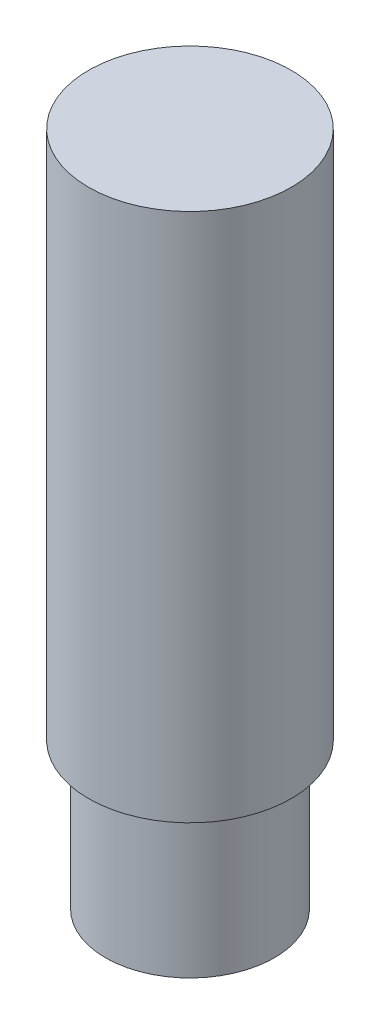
ISO-10303-21;
HEADER;
FILE_DESCRIPTION(('STEP AP214'),'2;1');
FILE_NAME('part.step','',(''),(''),'','','');
FILE_SCHEMA(('AUTOMOTIVE_DESIGN { 1 0 10303 214 1 1 1 1 }'));
ENDSEC;
DATA;
#1=APPLICATION_CONTEXT('core data for automotive mechanical design processes');
#2=APPLICATION_PROTOCOL_DEFINITION('international standard','automotive_design',2000,#1);
#3=PRODUCT_CONTEXT('',#1,'mechanical');
#4=PRODUCT('Part','Part','',(#3));
#5=PRODUCT_RELATED_PRODUCT_CATEGORY('part','',(#4));
#6=PRODUCT_DEFINITION_FORMATION('','',#4);
#7=PRODUCT_DEFINITION_CONTEXT('part definition',#1,'design');
#8=PRODUCT_DEFINITION('design','',#6,#7);
#9=PRODUCT_DEFINITION_SHAPE('','',#8);
#10=(LENGTH_UNIT() NAMED_UNIT(*) SI_UNIT(.MILLI.,.METRE.));
#11=(NAMED_UNIT(*) PLANE_ANGLE_UNIT() SI_UNIT($,.RADIAN.));
#12=(NAMED_UNIT(*) SI_UNIT($,.STERADIAN.) SOLID_ANGLE_UNIT());
#13=UNCERTAINTY_MEASURE_WITH_UNIT(LENGTH_MEASURE(1.E-05),#10,'distance_accuracy_value','');
#14=(GEOMETRIC_REPRESENTATION_CONTEXT(3) GLOBAL_UNCERTAINTY_ASSIGNED_CONTEXT((#13)) GLOBAL_UNIT_ASSIGNED_CONTEXT((#10,
#11,#12)) REPRESENTATION_CONTEXT('',''));
#15=CARTESIAN_POINT('',(0.,0.,0.));
#16=DIRECTION('',(0.,0.,1.));
#17=DIRECTION('',(1.,0.,0.));
#18=AXIS2_PLACEMENT_3D('',#15,#16,#17);
#19=CARTESIAN_POINT('',(0.,7.62,0.));
#20=DIRECTION('',(0.,-1.,0.));
#21=DIRECTION('',(0.,0.,-1.));
#22=AXIS2_PLACEMENT_3D('',#19,#20,#21);
#23=CYLINDRICAL_SURFACE('',#22,1.905);
#24=CARTESIAN_POINT('',(0.,-7.62,0.));
#25=DIRECTION('',(0.,1.,0.));
#26=DIRECTION('',(0.,0.,1.));
#27=AXIS2_PLACEMENT_3D('',#24,#25,#26);
#28=CIRCLE('',#27,1.905);
#29=CARTESIAN_POINT('',(0.,-7.62,-1.905));
#30=VERTEX_POINT('',#29);
#31=EDGE_CURVE('E39',#30,#30,#28,.T.);
#32=CARTESIAN_POINT('',(0.,-4.32,0.));
#33=DIRECTION('',(0.,1.,0.));
#34=DIRECTION('',(0.,0.,1.));
#35=AXIS2_PLACEMENT_3D('',#32,#33,#34);
#36=CIRCLE('',#35,1.905);
#37=CARTESIAN_POINT('',(0.,-4.32,-1.905));
#38=VERTEX_POINT('',#37);
#39=EDGE_CURVE('E11',#38,#38,#36,.T.);
#40=CARTESIAN_POINT('',(0.,-7.62,-1.905));
#41=CARTESIAN_POINT('',(0.,-7.585625,-1.905));
#42=CARTESIAN_POINT('',(0.,-7.55125,-1.905));
#43=CARTESIAN_POINT('',(0.,-7.4825,-1.905));
#44=CARTESIAN_POINT('',(0.,-7.448125,-1.905));
#45=CARTESIAN_POINT('',(0.,-7.379375,-1.905));
#46=CARTESIAN_POINT('',(0.,-7.345,-1.905));
#47=CARTESIAN_POINT('',(0.,-7.27625,-1.905));
#48=CARTESIAN_POINT('',(0.,-7.241875,-1.905));
#49=CARTESIAN_POINT('',(0.,-7.173125,-1.905));
#50=CARTESIAN_POINT('',(0.,-7.13875,-1.905));
#51=CARTESIAN_POINT('',(0.,-7.07,-1.905));
#52=CARTESIAN_POINT('',(0.,-7.035625,-1.905));
#53=CARTESIAN_POINT('',(0.,-6.966875,-1.905));
#54=CARTESIAN_POINT('',(0.,-6.9325,-1.905));
#55=CARTESIAN_POINT('',(0.,-6.86375,-1.905));
#56=CARTESIAN_POINT('',(0.,-6.829375,-1.905));
#57=CARTESIAN_POINT('',(0.,-6.760625,-1.905));
#58=CARTESIAN_POINT('',(0.,-6.72625,-1.905));
#59=CARTESIAN_POINT('',(0.,-6.6575,-1.905));
#60=CARTESIAN_POINT('',(0.,-6.623125,-1.905));
#61=CARTESIAN_POINT('',(0.,-6.554375,-1.905));
#62=CARTESIAN_POINT('',(0.,-6.52,-1.905));
#63=CARTESIAN_POINT('',(0.,-6.45125,-1.905));
#64=CARTESIAN_POINT('',(0.,-6.416875,-1.905));
#65=CARTESIAN_POINT('',(0.,-6.348125,-1.905));
#66=CARTESIAN_POINT('',(0.,-6.31375,-1.905));
#67=CARTESIAN_POINT('',(0.,-6.245,-1.905));
#68=CARTESIAN_POINT('',(0.,-6.210625,-1.905));
#69=CARTESIAN_POINT('',(0.,-6.141875,-1.905));
#70=CARTESIAN_POINT('',(0.,-6.1075,-1.905));
#71=CARTESIAN_POINT('',(0.,-6.03875,-1.905));
#72=CARTESIAN_POINT('',(0.,-6.004375,-1.905));
#73=CARTESIAN_POINT('',(0.,-5.935625,-1.905));
#74=CARTESIAN_POINT('',(0.,-5.90125,-1.905));
#75=CARTESIAN_POINT('',(0.,-5.8325,-1.905));
#76=CARTESIAN_POINT('',(0.,-5.798125,-1.905));
#77=CARTESIAN_POINT('',(0.,-5.729375,-1.905));
#78=CARTESIAN_POINT('',(0.,-5.695,-1.905));
#79=CARTESIAN_POINT('',(0.,-5.62625,-1.905));
#80=CARTESIAN_POINT('',(0.,-5.591875,-1.905));
#81=CARTESIAN_POINT('',(0.,-5.523125,-1.905));
#82=CARTESIAN_POINT('',(0.,-5.48875,-1.905));
#83=CARTESIAN_POINT('',(0.,-5.42,-1.905));
#84=CARTESIAN_POINT('',(0.,-5.385625,-1.905));
#85=CARTESIAN_POINT('',(0.,-5.316875,-1.905));
#86=CARTESIAN_POINT('',(0.,-5.2825,-1.905));
#87=CARTESIAN_POINT('',(0.,-5.21375,-1.905));
#88=CARTESIAN_POINT('',(0.,-5.179375,-1.905));
#89=CARTESIAN_POINT('',(0.,-5.110625,-1.905));
#90=CARTESIAN_POINT('',(0.,-5.07625,-1.905));
#91=CARTESIAN_POINT('',(0.,-5.0075,-1.905));
#92=CARTESIAN_POINT('',(0.,-4.973125,-1.905));
#93=CARTESIAN_POINT('',(0.,-4.904375,-1.905));
#94=CARTESIAN_POINT('',(0.,-4.87,-1.905));
#95=CARTESIAN_POINT('',(0.,-4.80125,-1.905));
#96=CARTESIAN_POINT('',(0.,-4.766875,-1.905));
#97=CARTESIAN_POINT('',(0.,-4.698125,-1.905));
#98=CARTESIAN_POINT('',(0.,-4.66375,-1.905));
#99=CARTESIAN_POINT('',(0.,-4.595,-1.905));
#100=CARTESIAN_POINT('',(0.,-4.560625,-1.905));
#101=CARTESIAN_POINT('',(0.,-4.491875,-1.905));
#102=CARTESIAN_POINT('',(0.,-4.4575,-1.905));
#103=CARTESIAN_POINT('',(0.,-4.38875,-1.905));
#104=CARTESIAN_POINT('',(0.,-4.354375,-1.905));
#105=CARTESIAN_POINT('',(0.,-4.32,-1.905));
#106=B_SPLINE_CURVE_WITH_KNOTS('',3,(#40,#41,#42,#43,#44,#45,#46,#47,#48,#49,#50,#51,#52,#53,
#54,#55,#56,#57,#58,#59,#60,#61,#62,#63,#64,#65,#66,#67,#68,#69,#70,#71,#72,#73,#74,#75,#76,#77,
#78,#79,#80,#81,#82,#83,#84,#85,#86,#87,#88,#89,#90,#91,#92,#93,#94,#95,#96,#97,#98,#99,#100,
#101,#102,#103,#104,#105),.UNSPECIFIED.,.F.,.F.,(4,2,2,2,2,2,2,2,2,2,2,2,2,2,2,2,2,2,2,2,2,2,2,
2,2,2,2,2,2,2,2,2,4),(0.,0.103124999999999,0.20625,0.309375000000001,0.4125,0.515624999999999,
0.618749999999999,0.721875,0.824999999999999,0.928124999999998,1.03125,1.134375,1.2375,1.340625,
1.44375,1.546875,1.65,1.753125,1.85625,1.959375,2.0625,2.165625,2.26875,2.371875,2.475,2.578125,
2.68125,2.784375,2.8875,2.990625,3.09375,3.196875,3.3),.UNSPECIFIED.);
#107=EDGE_CURVE('BSEAM33',#30,#38,#106,.T.);
#108=ORIENTED_EDGE('',*,*,#31,.T.);
#109=ORIENTED_EDGE('',*,*,#39,.F.);
#110=ORIENTED_EDGE('',*,*,#107,.T.);
#111=ORIENTED_EDGE('',*,*,#107,.F.);
#112=EDGE_LOOP('',(#108,#110,#109,#111));
#113=FACE_BOUND('',#112,.T.);
#114=ADVANCED_FACE('F33',(#113),#23,.T.);
#115=CARTESIAN_POINT('',(0.,-7.62,0.));
#116=DIRECTION('',(0.,1.,0.));
#117=DIRECTION('',(0.,0.,1.));
#118=AXIS2_PLACEMENT_3D('',#115,#116,#117);
#119=PLANE('',#118);
#120=ORIENTED_EDGE('',*,*,#31,.F.);
#121=EDGE_LOOP('',(#120));
#122=FACE_BOUND('',#121,.T.);
#123=ADVANCED_FACE('F64',(#122),#119,.F.);
#124=CARTESIAN_POINT('',(0.,-4.32,0.));
#125=DIRECTION('',(0.,1.,0.));
#126=DIRECTION('',(0.,0.,1.));
#127=AXIS2_PLACEMENT_3D('',#124,#125,#126);
#128=PLANE('',#127);
#129=CARTESIAN_POINT('',(0.,-4.32,0.));
#130=DIRECTION('',(0.,1.,0.));
#131=DIRECTION('',(0.,0.,1.));
#132=AXIS2_PLACEMENT_3D('',#129,#130,#131);
#133=CIRCLE('',#132,2.286);
#134=CARTESIAN_POINT('',(0.,-4.32,2.286));
#135=VERTEX_POINT('',#134);
#136=EDGE_CURVE('E43',#135,#135,#133,.F.);
#137=ORIENTED_EDGE('',*,*,#136,.T.);
#138=EDGE_LOOP('',(#137));
#139=FACE_BOUND('',#138,.T.);
#140=ORIENTED_EDGE('',*,*,#39,.T.);
#141=EDGE_LOOP('',(#140));
#142=FACE_BOUND('',#141,.T.);
#143=ADVANCED_FACE('F57',(#139,#142),#128,.F.);
#144=CARTESIAN_POINT('',(0.,-14.0857844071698,0.));
#145=DIRECTION('',(0.,1.,0.));
#146=DIRECTION('',(0.,0.,1.));
#147=AXIS2_PLACEMENT_3D('',#144,#145,#146);
#148=CYLINDRICAL_SURFACE('',#147,2.286);
#149=CARTESIAN_POINT('',(0.,7.62,0.));
#150=DIRECTION('',(0.,1.,0.));
#151=DIRECTION('',(0.,0.,1.));
#152=AXIS2_PLACEMENT_3D('',#149,#150,#151);
#153=CIRCLE('',#152,2.286);
#154=CARTESIAN_POINT('',(0.,7.62,2.286));
#155=VERTEX_POINT('',#154);
#156=EDGE_CURVE('E47',#155,#155,#153,.T.);
#157=CARTESIAN_POINT('',(0.,-4.32,2.286));
#158=CARTESIAN_POINT('',(0.,-4.195625,2.286));
#159=CARTESIAN_POINT('',(0.,-4.07125,2.286));
#160=CARTESIAN_POINT('',(0.,-3.8225,2.286));
#161=CARTESIAN_POINT('',(0.,-3.698125,2.286));
#162=CARTESIAN_POINT('',(0.,-3.449375,2.286));
#163=CARTESIAN_POINT('',(0.,-3.325,2.286));
#164=CARTESIAN_POINT('',(0.,-3.07625,2.286));
#165=CARTESIAN_POINT('',(0.,-2.951875,2.286));
#166=CARTESIAN_POINT('',(0.,-2.703125,2.286));
#167=CARTESIAN_POINT('',(0.,-2.57875,2.286));
#168=CARTESIAN_POINT('',(0.,-2.33,2.286));
#169=CARTESIAN_POINT('',(0.,-2.205625,2.286));
#170=CARTESIAN_POINT('',(0.,-1.956875,2.286));
#171=CARTESIAN_POINT('',(0.,-1.8325,2.286));
#172=CARTESIAN_POINT('',(0.,-1.58375,2.286));
#173=CARTESIAN_POINT('',(0.,-1.459375,2.286));
#174=CARTESIAN_POINT('',(0.,-1.210625,2.286));
#175=CARTESIAN_POINT('',(0.,-1.08625,2.286));
#176=CARTESIAN_POINT('',(0.,-0.837499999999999,2.286));
#177=CARTESIAN_POINT('',(0.,-0.713124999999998,2.286));
#178=CARTESIAN_POINT('',(0.,-0.464374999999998,2.286));
#179=CARTESIAN_POINT('',(0.,-0.339999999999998,2.286));
#180=CARTESIAN_POINT('',(0.,-0.0912499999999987,2.286));
#181=CARTESIAN_POINT('',(0.,0.0331250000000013,2.286));
#182=CARTESIAN_POINT('',(0.,0.281875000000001,2.286));
#183=CARTESIAN_POINT('',(0.,0.406250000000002,2.286));
#184=CARTESIAN_POINT('',(0.,0.655000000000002,2.286));
#185=CARTESIAN_POINT('',(0.,0.779375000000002,2.286));
#186=CARTESIAN_POINT('',(0.,1.028125,2.286));
#187=CARTESIAN_POINT('',(0.,1.1525,2.286));
#188=CARTESIAN_POINT('',(0.,1.40125,2.286));
#189=CARTESIAN_POINT('',(0.,1.525625,2.286));
#190=CARTESIAN_POINT('',(0.,1.774375,2.286));
#191=CARTESIAN_POINT('',(0.,1.89875,2.286));
#192=CARTESIAN_POINT('',(0.,2.1475,2.286));
#193=CARTESIAN_POINT('',(0.,2.271875,2.286));
#194=CARTESIAN_POINT('',(0.,2.520625,2.286));
#195=CARTESIAN_POINT('',(0.,2.645,2.286));
#196=CARTESIAN_POINT('',(0.,2.89375,2.286));
#197=CARTESIAN_POINT('',(0.,3.018125,2.286));
#198=CARTESIAN_POINT('',(0.,3.266875,2.286));
#199=CARTESIAN_POINT('',(0.,3.39125,2.286));
#200=CARTESIAN_POINT('',(0.,3.64,2.286));
#201=CARTESIAN_POINT('',(0.,3.764375,2.286));
#202=CARTESIAN_POINT('',(0.,4.013125,2.286));
#203=CARTESIAN_POINT('',(0.,4.1375,2.286));
#204=CARTESIAN_POINT('',(0.,4.38625,2.286));
#205=CARTESIAN_POINT('',(0.,4.510625,2.286));
#206=CARTESIAN_POINT('',(0.,4.759375,2.286));
#207=CARTESIAN_POINT('',(0.,4.88375,2.286));
#208=CARTESIAN_POINT('',(0.,5.1325,2.286));
#209=CARTESIAN_POINT('',(0.,5.256875,2.286));
#210=CARTESIAN_POINT('',(0.,5.505625,2.286));
#211=CARTESIAN_POINT('',(0.,5.63,2.286));
#212=CARTESIAN_POINT('',(0.,5.87875,2.286));
#213=CARTESIAN_POINT('',(0.,6.003125,2.286));
#214=CARTESIAN_POINT('',(0.,6.251875,2.286));
#215=CARTESIAN_POINT('',(0.,6.37625,2.286));
#216=CARTESIAN_POINT('',(0.,6.625,2.286));
#217=CARTESIAN_POINT('',(0.,6.749375,2.286));
#218=CARTESIAN_POINT('',(0.,6.998125,2.286));
#219=CARTESIAN_POINT('',(0.,7.1225,2.286));
#220=CARTESIAN_POINT('',(0.,7.37125,2.286));
#221=CARTESIAN_POINT('',(0.,7.495625,2.286));
#222=CARTESIAN_POINT('',(0.,7.62,2.286));
#223=B_SPLINE_CURVE_WITH_KNOTS('',3,(#157,#158,#159,#160,#161,#162,#163,#164,#165,#166,#167,
#168,#169,#170,#171,#172,#173,#174,#175,#176,#177,#178,#179,#180,#181,#182,#183,#184,#185,#186,
#187,#188,#189,#190,#191,#192,#193,#194,#195,#196,#197,#198,#199,#200,#201,#202,#203,#204,#205,
#206,#207,#208,#209,#210,#211,#212,#213,#214,#215,#216,#217,#218,#219,#220,#221,#222),
.UNSPECIFIED.,.F.,.F.,(4,2,2,2,2,2,2,2,2,2,2,2,2,2,2,2,2,2,2,2,2,2,2,2,2,2,2,2,2,2,2,2,4),(0.,
0.373125,0.74625,1.119375,1.4925,1.865625,2.23875,2.611875,2.985,3.358125,3.73125,4.104375,
4.4775,4.850625,5.22375,5.596875,5.97,6.343125,6.71625,7.089375,7.4625,7.835625,8.20875,
8.581875,8.955,9.328125,9.70125,10.074375,10.4475,10.820625,11.19375,11.566875,11.94),.UNSPECIFIED.);
#224=EDGE_CURVE('BSEAM55',#135,#155,#223,.T.);
#225=ORIENTED_EDGE('',*,*,#136,.F.);
#226=ORIENTED_EDGE('',*,*,#156,.F.);
#227=ORIENTED_EDGE('',*,*,#224,.T.);
#228=ORIENTED_EDGE('',*,*,#224,.F.);
#229=EDGE_LOOP('',(#225,#227,#226,#228));
#230=FACE_BOUND('',#229,.T.);
#231=ADVANCED_FACE('F55',(#230),#148,.T.);
#232=CARTESIAN_POINT('',(0.,7.62,0.));
#233=DIRECTION('',(0.,1.,0.));
#234=DIRECTION('',(0.,0.,1.));
#235=AXIS2_PLACEMENT_3D('',#232,#233,#234);
#236=PLANE('',#235);
#237=ORIENTED_EDGE('',*,*,#156,.T.);
#238=EDGE_LOOP('',(#237));
#239=FACE_BOUND('',#238,.T.);
#240=ADVANCED_FACE('F53',(#239),#236,.T.);
#241=CLOSED_SHELL('',(#114,#123,#143,#231,#240));
#242=MANIFOLD_SOLID_BREP('B2',#241);
#243=ADVANCED_BREP_SHAPE_REPRESENTATION('',(#18,#242),#14);
#244=SHAPE_DEFINITION_REPRESENTATION(#9,#243);
ENDSEC;
END-ISO-10303-21;
